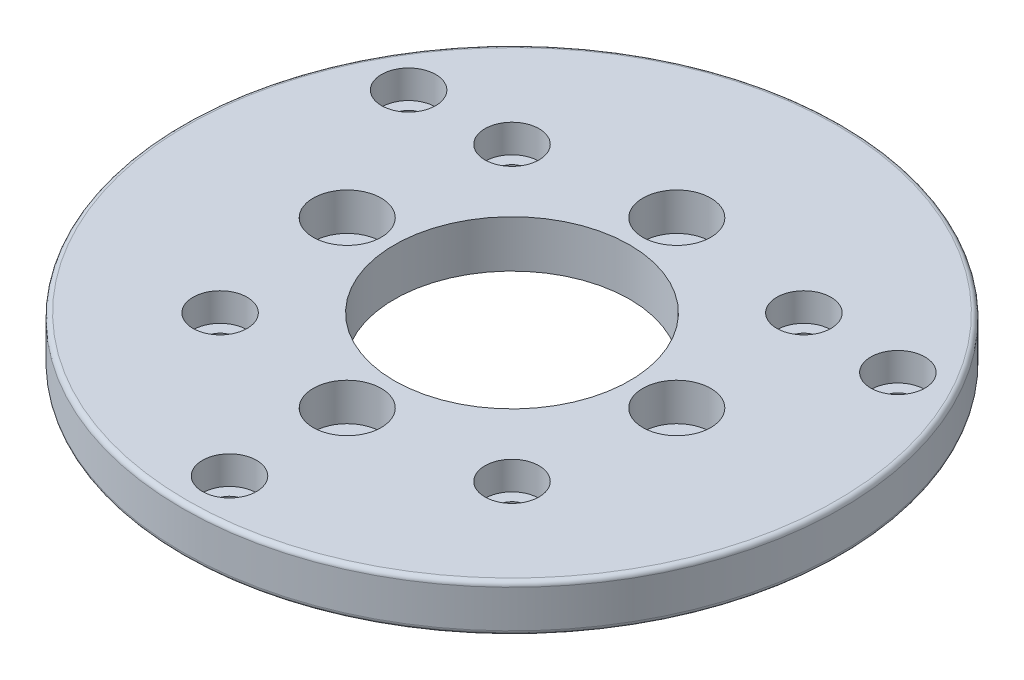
ISO-10303-21;
HEADER;
FILE_DESCRIPTION(('STEP AP214'),'2;1');
FILE_NAME('part.step','',(''),(''),'','','');
FILE_SCHEMA(('AUTOMOTIVE_DESIGN { 1 0 10303 214 1 1 1 1 }'));
ENDSEC;
DATA;
#1=APPLICATION_CONTEXT('core data for automotive mechanical design processes');
#2=APPLICATION_PROTOCOL_DEFINITION('international standard','automotive_design',2000,#1);
#3=PRODUCT_CONTEXT('',#1,'mechanical');
#4=PRODUCT('Part','Part','',(#3));
#5=PRODUCT_RELATED_PRODUCT_CATEGORY('part','',(#4));
#6=PRODUCT_DEFINITION_FORMATION('','',#4);
#7=PRODUCT_DEFINITION_CONTEXT('part definition',#1,'design');
#8=PRODUCT_DEFINITION('design','',#6,#7);
#9=PRODUCT_DEFINITION_SHAPE('','',#8);
#10=(LENGTH_UNIT() NAMED_UNIT(*) SI_UNIT(.MILLI.,.METRE.));
#11=(NAMED_UNIT(*) PLANE_ANGLE_UNIT() SI_UNIT($,.RADIAN.));
#12=(NAMED_UNIT(*) SI_UNIT($,.STERADIAN.) SOLID_ANGLE_UNIT());
#13=UNCERTAINTY_MEASURE_WITH_UNIT(LENGTH_MEASURE(1.E-05),#10,'distance_accuracy_value','');
#14=(GEOMETRIC_REPRESENTATION_CONTEXT(3) GLOBAL_UNCERTAINTY_ASSIGNED_CONTEXT((#13)) GLOBAL_UNIT_ASSIGNED_CONTEXT((#10,
#11,#12)) REPRESENTATION_CONTEXT('',''));
#15=CARTESIAN_POINT('',(0.,0.,0.));
#16=DIRECTION('',(0.,0.,1.));
#17=DIRECTION('',(1.,0.,0.));
#18=AXIS2_PLACEMENT_3D('',#15,#16,#17);
#19=CARTESIAN_POINT('',(17.5,5.,0.));
#20=DIRECTION('',(0.,-1.,0.));
#21=DIRECTION('',(0.,0.,-1.));
#22=AXIS2_PLACEMENT_3D('',#19,#20,#21);
#23=CYLINDRICAL_SURFACE('',#22,2.05);
#24=CARTESIAN_POINT('',(17.5,0.,0.));
#25=DIRECTION('',(0.,1.,0.));
#26=DIRECTION('',(0.,0.,1.));
#27=AXIS2_PLACEMENT_3D('',#24,#25,#26);
#28=CIRCLE('',#27,2.05);
#29=CARTESIAN_POINT('',(17.5,0.,2.05));
#30=VERTEX_POINT('',#29);
#31=EDGE_CURVE('E181',#30,#30,#28,.T.);
#32=ORIENTED_EDGE('',*,*,#31,.F.);
#33=EDGE_LOOP('',(#32));
#34=FACE_BOUND('',#33,.T.);
#35=CARTESIAN_POINT('',(17.5,1.,0.));
#36=DIRECTION('',(0.,1.,0.));
#37=DIRECTION('',(0.,0.,1.));
#38=AXIS2_PLACEMENT_3D('',#35,#36,#37);
#39=CIRCLE('',#38,2.05);
#40=CARTESIAN_POINT('',(17.5,1.,2.05));
#41=VERTEX_POINT('',#40);
#42=EDGE_CURVE('E40',#41,#41,#39,.T.);
#43=ORIENTED_EDGE('',*,*,#42,.T.);
#44=EDGE_LOOP('',(#43));
#45=FACE_BOUND('',#44,.T.);
#46=ADVANCED_FACE('F36',(#34,#45),#23,.F.);
#47=CARTESIAN_POINT('',(0.,5.,-17.5));
#48=DIRECTION('',(0.,-1.,0.));
#49=DIRECTION('',(0.,0.,-1.));
#50=AXIS2_PLACEMENT_3D('',#47,#48,#49);
#51=CYLINDRICAL_SURFACE('',#50,2.05);
#52=CARTESIAN_POINT('',(0.,0.,-17.5));
#53=DIRECTION('',(0.,1.,0.));
#54=DIRECTION('',(0.,0.,1.));
#55=AXIS2_PLACEMENT_3D('',#52,#53,#54);
#56=CIRCLE('',#55,2.05);
#57=CARTESIAN_POINT('',(0.,0.,-15.45));
#58=VERTEX_POINT('',#57);
#59=EDGE_CURVE('E177',#58,#58,#56,.T.);
#60=ORIENTED_EDGE('',*,*,#59,.F.);
#61=EDGE_LOOP('',(#60));
#62=FACE_BOUND('',#61,.T.);
#63=CARTESIAN_POINT('',(0.,1.,-17.5));
#64=DIRECTION('',(0.,1.,0.));
#65=DIRECTION('',(0.,0.,1.));
#66=AXIS2_PLACEMENT_3D('',#63,#64,#65);
#67=CIRCLE('',#66,2.05);
#68=CARTESIAN_POINT('',(0.,1.,-15.45));
#69=VERTEX_POINT('',#68);
#70=EDGE_CURVE('E94',#69,#69,#67,.T.);
#71=ORIENTED_EDGE('',*,*,#70,.T.);
#72=EDGE_LOOP('',(#71));
#73=FACE_BOUND('',#72,.T.);
#74=ADVANCED_FACE('F230',(#62,#73),#51,.F.);
#75=CARTESIAN_POINT('',(-17.5,5.,0.));
#76=DIRECTION('',(0.,-1.,0.));
#77=DIRECTION('',(0.,0.,-1.));
#78=AXIS2_PLACEMENT_3D('',#75,#76,#77);
#79=CYLINDRICAL_SURFACE('',#78,2.05);
#80=CARTESIAN_POINT('',(-17.5,0.,0.));
#81=DIRECTION('',(0.,1.,0.));
#82=DIRECTION('',(0.,0.,1.));
#83=AXIS2_PLACEMENT_3D('',#80,#81,#82);
#84=CIRCLE('',#83,2.05);
#85=CARTESIAN_POINT('',(-17.5,0.,2.05));
#86=VERTEX_POINT('',#85);
#87=EDGE_CURVE('E173',#86,#86,#84,.T.);
#88=ORIENTED_EDGE('',*,*,#87,.F.);
#89=EDGE_LOOP('',(#88));
#90=FACE_BOUND('',#89,.T.);
#91=CARTESIAN_POINT('',(-17.5,1.,0.));
#92=DIRECTION('',(0.,1.,0.));
#93=DIRECTION('',(0.,0.,1.));
#94=AXIS2_PLACEMENT_3D('',#91,#92,#93);
#95=CIRCLE('',#94,2.05);
#96=CARTESIAN_POINT('',(-17.5,1.,2.05));
#97=VERTEX_POINT('',#96);
#98=EDGE_CURVE('E90',#97,#97,#95,.T.);
#99=ORIENTED_EDGE('',*,*,#98,.T.);
#100=EDGE_LOOP('',(#99));
#101=FACE_BOUND('',#100,.T.);
#102=ADVANCED_FACE('F236',(#90,#101),#79,.F.);
#103=CARTESIAN_POINT('',(0.,5.,17.5));
#104=DIRECTION('',(0.,-1.,0.));
#105=DIRECTION('',(0.,0.,-1.));
#106=AXIS2_PLACEMENT_3D('',#103,#104,#105);
#107=CYLINDRICAL_SURFACE('',#106,2.05);
#108=CARTESIAN_POINT('',(0.,0.,17.5));
#109=DIRECTION('',(0.,1.,0.));
#110=DIRECTION('',(0.,0.,1.));
#111=AXIS2_PLACEMENT_3D('',#108,#109,#110);
#112=CIRCLE('',#111,2.05);
#113=CARTESIAN_POINT('',(0.,0.,19.55));
#114=VERTEX_POINT('',#113);
#115=EDGE_CURVE('E170',#114,#114,#112,.T.);
#116=ORIENTED_EDGE('',*,*,#115,.F.);
#117=EDGE_LOOP('',(#116));
#118=FACE_BOUND('',#117,.T.);
#119=CARTESIAN_POINT('',(0.,1.,17.5));
#120=DIRECTION('',(0.,1.,0.));
#121=DIRECTION('',(0.,0.,1.));
#122=AXIS2_PLACEMENT_3D('',#119,#120,#121);
#123=CIRCLE('',#122,2.05);
#124=CARTESIAN_POINT('',(0.,1.,19.55));
#125=VERTEX_POINT('',#124);
#126=EDGE_CURVE('E86',#125,#125,#123,.T.);
#127=ORIENTED_EDGE('',*,*,#126,.T.);
#128=EDGE_LOOP('',(#127));
#129=FACE_BOUND('',#128,.T.);
#130=ADVANCED_FACE('F254',(#118,#129),#107,.F.);
#131=CARTESIAN_POINT('',(-25.9807621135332,5.,-15.));
#132=DIRECTION('',(0.,-1.,0.));
#133=DIRECTION('',(0.,0.,-1.));
#134=AXIS2_PLACEMENT_3D('',#131,#132,#133);
#135=CYLINDRICAL_SURFACE('',#134,1.6);
#136=CARTESIAN_POINT('',(-25.9807621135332,0.,-15.));
#137=DIRECTION('',(0.,1.,0.));
#138=DIRECTION('',(0.,0.,1.));
#139=AXIS2_PLACEMENT_3D('',#136,#137,#138);
#140=CIRCLE('',#139,1.6);
#141=CARTESIAN_POINT('',(-25.9807621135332,0.,-13.4));
#142=VERTEX_POINT('',#141);
#143=EDGE_CURVE('E200',#142,#142,#140,.T.);
#144=ORIENTED_EDGE('',*,*,#143,.F.);
#145=EDGE_LOOP('',(#144));
#146=FACE_BOUND('',#145,.T.);
#147=CARTESIAN_POINT('',(-25.9807621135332,2.,-15.));
#148=DIRECTION('',(0.,1.,0.));
#149=DIRECTION('',(0.,0.,1.));
#150=AXIS2_PLACEMENT_3D('',#147,#148,#149);
#151=CIRCLE('',#150,1.6);
#152=CARTESIAN_POINT('',(-25.9807621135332,2.,-13.4));
#153=VERTEX_POINT('',#152);
#154=EDGE_CURVE('E81',#153,#153,#151,.T.);
#155=ORIENTED_EDGE('',*,*,#154,.T.);
#156=EDGE_LOOP('',(#155));
#157=FACE_BOUND('',#156,.T.);
#158=ADVANCED_FACE('F250',(#146,#157),#135,.F.);
#159=CARTESIAN_POINT('',(25.9807621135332,5.,-15.));
#160=DIRECTION('',(0.,-1.,0.));
#161=DIRECTION('',(0.,0.,-1.));
#162=AXIS2_PLACEMENT_3D('',#159,#160,#161);
#163=CYLINDRICAL_SURFACE('',#162,1.6);
#164=CARTESIAN_POINT('',(25.9807621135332,0.,-15.));
#165=DIRECTION('',(0.,1.,0.));
#166=DIRECTION('',(0.,0.,1.));
#167=AXIS2_PLACEMENT_3D('',#164,#165,#166);
#168=CIRCLE('',#167,1.6);
#169=CARTESIAN_POINT('',(25.9807621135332,0.,-13.4));
#170=VERTEX_POINT('',#169);
#171=EDGE_CURVE('E196',#170,#170,#168,.T.);
#172=ORIENTED_EDGE('',*,*,#171,.F.);
#173=EDGE_LOOP('',(#172));
#174=FACE_BOUND('',#173,.T.);
#175=CARTESIAN_POINT('',(25.9807621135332,2.,-15.));
#176=DIRECTION('',(0.,1.,0.));
#177=DIRECTION('',(0.,0.,1.));
#178=AXIS2_PLACEMENT_3D('',#175,#176,#177);
#179=CIRCLE('',#178,1.6);
#180=CARTESIAN_POINT('',(25.9807621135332,2.,-13.4));
#181=VERTEX_POINT('',#180);
#182=EDGE_CURVE('E77',#181,#181,#179,.T.);
#183=ORIENTED_EDGE('',*,*,#182,.T.);
#184=EDGE_LOOP('',(#183));
#185=FACE_BOUND('',#184,.T.);
#186=ADVANCED_FACE('F246',(#174,#185),#163,.F.);
#187=CARTESIAN_POINT('',(0.,5.,30.));
#188=DIRECTION('',(0.,-1.,0.));
#189=DIRECTION('',(0.,0.,-1.));
#190=AXIS2_PLACEMENT_3D('',#187,#188,#189);
#191=CYLINDRICAL_SURFACE('',#190,1.6);
#192=CARTESIAN_POINT('',(0.,0.,30.));
#193=DIRECTION('',(0.,1.,0.));
#194=DIRECTION('',(0.,0.,1.));
#195=AXIS2_PLACEMENT_3D('',#192,#193,#194);
#196=CIRCLE('',#195,1.6);
#197=CARTESIAN_POINT('',(0.,0.,31.6));
#198=VERTEX_POINT('',#197);
#199=EDGE_CURVE('E189',#198,#198,#196,.T.);
#200=ORIENTED_EDGE('',*,*,#199,.F.);
#201=EDGE_LOOP('',(#200));
#202=FACE_BOUND('',#201,.T.);
#203=CARTESIAN_POINT('',(0.,2.,30.));
#204=DIRECTION('',(0.,1.,0.));
#205=DIRECTION('',(0.,0.,1.));
#206=AXIS2_PLACEMENT_3D('',#203,#204,#205);
#207=CIRCLE('',#206,1.6);
#208=CARTESIAN_POINT('',(0.,2.,31.6));
#209=VERTEX_POINT('',#208);
#210=EDGE_CURVE('E73',#209,#209,#207,.T.);
#211=ORIENTED_EDGE('',*,*,#210,.T.);
#212=EDGE_LOOP('',(#211));
#213=FACE_BOUND('',#212,.T.);
#214=ADVANCED_FACE('F242',(#202,#213),#191,.F.);
#215=CARTESIAN_POINT('',(-15.5,5.,-15.5));
#216=DIRECTION('',(0.,-1.,0.));
#217=DIRECTION('',(0.,0.,-1.));
#218=AXIS2_PLACEMENT_3D('',#215,#216,#217);
#219=CYLINDRICAL_SURFACE('',#218,1.6);
#220=CARTESIAN_POINT('',(-15.5,0.,-15.5));
#221=DIRECTION('',(0.,1.,0.));
#222=DIRECTION('',(0.,0.,1.));
#223=AXIS2_PLACEMENT_3D('',#220,#221,#222);
#224=CIRCLE('',#223,1.6);
#225=CARTESIAN_POINT('',(-15.5,0.,-13.9));
#226=VERTEX_POINT('',#225);
#227=EDGE_CURVE('E166',#226,#226,#224,.T.);
#228=ORIENTED_EDGE('',*,*,#227,.F.);
#229=EDGE_LOOP('',(#228));
#230=FACE_BOUND('',#229,.T.);
#231=CARTESIAN_POINT('',(-15.5,2.,-15.5));
#232=DIRECTION('',(0.,1.,0.));
#233=DIRECTION('',(0.,0.,1.));
#234=AXIS2_PLACEMENT_3D('',#231,#232,#233);
#235=CIRCLE('',#234,1.6);
#236=CARTESIAN_POINT('',(-15.5,2.,-13.9));
#237=VERTEX_POINT('',#236);
#238=EDGE_CURVE('E69',#237,#237,#235,.T.);
#239=ORIENTED_EDGE('',*,*,#238,.T.);
#240=EDGE_LOOP('',(#239));
#241=FACE_BOUND('',#240,.T.);
#242=ADVANCED_FACE('F245',(#230,#241),#219,.F.);
#243=CARTESIAN_POINT('',(15.5,5.,-15.5));
#244=DIRECTION('',(0.,-1.,0.));
#245=DIRECTION('',(0.,0.,-1.));
#246=AXIS2_PLACEMENT_3D('',#243,#244,#245);
#247=CYLINDRICAL_SURFACE('',#246,1.6);
#248=CARTESIAN_POINT('',(15.5,0.,-15.5));
#249=DIRECTION('',(0.,1.,0.));
#250=DIRECTION('',(0.,0.,1.));
#251=AXIS2_PLACEMENT_3D('',#248,#249,#250);
#252=CIRCLE('',#251,1.6);
#253=CARTESIAN_POINT('',(15.5,0.,-13.9));
#254=VERTEX_POINT('',#253);
#255=EDGE_CURVE('E162',#254,#254,#252,.T.);
#256=ORIENTED_EDGE('',*,*,#255,.F.);
#257=EDGE_LOOP('',(#256));
#258=FACE_BOUND('',#257,.T.);
#259=CARTESIAN_POINT('',(15.5,2.,-15.5));
#260=DIRECTION('',(0.,1.,0.));
#261=DIRECTION('',(0.,0.,1.));
#262=AXIS2_PLACEMENT_3D('',#259,#260,#261);
#263=CIRCLE('',#262,1.6);
#264=CARTESIAN_POINT('',(15.5,2.,-13.9));
#265=VERTEX_POINT('',#264);
#266=EDGE_CURVE('E65',#265,#265,#263,.T.);
#267=ORIENTED_EDGE('',*,*,#266,.T.);
#268=EDGE_LOOP('',(#267));
#269=FACE_BOUND('',#268,.T.);
#270=ADVANCED_FACE('F323',(#258,#269),#247,.F.);
#271=CARTESIAN_POINT('',(15.5,5.,15.5));
#272=DIRECTION('',(0.,-1.,0.));
#273=DIRECTION('',(0.,0.,-1.));
#274=AXIS2_PLACEMENT_3D('',#271,#272,#273);
#275=CYLINDRICAL_SURFACE('',#274,1.6);
#276=CARTESIAN_POINT('',(15.5,0.,15.5));
#277=DIRECTION('',(0.,1.,0.));
#278=DIRECTION('',(0.,0.,1.));
#279=AXIS2_PLACEMENT_3D('',#276,#277,#278);
#280=CIRCLE('',#279,1.6);
#281=CARTESIAN_POINT('',(15.5,0.,17.1));
#282=VERTEX_POINT('',#281);
#283=EDGE_CURVE('E158',#282,#282,#280,.T.);
#284=ORIENTED_EDGE('',*,*,#283,.F.);
#285=EDGE_LOOP('',(#284));
#286=FACE_BOUND('',#285,.T.);
#287=CARTESIAN_POINT('',(15.5,2.,15.5));
#288=DIRECTION('',(0.,1.,0.));
#289=DIRECTION('',(0.,0.,1.));
#290=AXIS2_PLACEMENT_3D('',#287,#288,#289);
#291=CIRCLE('',#290,1.6);
#292=CARTESIAN_POINT('',(15.5,2.,17.1));
#293=VERTEX_POINT('',#292);
#294=EDGE_CURVE('E60',#293,#293,#291,.T.);
#295=ORIENTED_EDGE('',*,*,#294,.T.);
#296=EDGE_LOOP('',(#295));
#297=FACE_BOUND('',#296,.T.);
#298=ADVANCED_FACE('F311',(#286,#297),#275,.F.);
#299=CARTESIAN_POINT('',(-15.5,5.,15.5));
#300=DIRECTION('',(0.,-1.,0.));
#301=DIRECTION('',(0.,0.,-1.));
#302=AXIS2_PLACEMENT_3D('',#299,#300,#301);
#303=CYLINDRICAL_SURFACE('',#302,1.6);
#304=CARTESIAN_POINT('',(-15.5,0.,15.5));
#305=DIRECTION('',(0.,1.,0.));
#306=DIRECTION('',(0.,0.,1.));
#307=AXIS2_PLACEMENT_3D('',#304,#305,#306);
#308=CIRCLE('',#307,1.6);
#309=CARTESIAN_POINT('',(-15.5,0.,17.1));
#310=VERTEX_POINT('',#309);
#311=EDGE_CURVE('E85',#310,#310,#308,.T.);
#312=ORIENTED_EDGE('',*,*,#311,.F.);
#313=EDGE_LOOP('',(#312));
#314=FACE_BOUND('',#313,.T.);
#315=CARTESIAN_POINT('',(-15.5,2.,15.5));
#316=DIRECTION('',(0.,1.,0.));
#317=DIRECTION('',(0.,0.,1.));
#318=AXIS2_PLACEMENT_3D('',#315,#316,#317);
#319=CIRCLE('',#318,1.6);
#320=CARTESIAN_POINT('',(-15.5,2.,17.1));
#321=VERTEX_POINT('',#320);
#322=EDGE_CURVE('E56',#321,#321,#319,.T.);
#323=ORIENTED_EDGE('',*,*,#322,.T.);
#324=EDGE_LOOP('',(#323));
#325=FACE_BOUND('',#324,.T.);
#326=ADVANCED_FACE('F260',(#314,#325),#303,.F.);
#327=CARTESIAN_POINT('',(0.,5.,0.));
#328=DIRECTION('',(0.,1.,0.));
#329=DIRECTION('',(0.,0.,1.));
#330=AXIS2_PLACEMENT_3D('',#327,#328,#329);
#331=PLANE('',#330);
#332=CARTESIAN_POINT('',(0.,5.,-17.5));
#333=DIRECTION('',(0.,1.,0.));
#334=DIRECTION('',(0.,0.,1.));
#335=AXIS2_PLACEMENT_3D('',#332,#333,#334);
#336=CIRCLE('',#335,3.61);
#337=CARTESIAN_POINT('',(0.,5.,-13.89));
#338=VERTEX_POINT('',#337);
#339=EDGE_CURVE('E690',#338,#338,#336,.T.);
#340=ORIENTED_EDGE('',*,*,#339,.F.);
#341=EDGE_LOOP('',(#340));
#342=FACE_BOUND('',#341,.T.);
#343=CARTESIAN_POINT('',(17.5,5.,0.));
#344=DIRECTION('',(0.,1.,0.));
#345=DIRECTION('',(0.,0.,1.));
#346=AXIS2_PLACEMENT_3D('',#343,#344,#345);
#347=CIRCLE('',#346,3.61);
#348=CARTESIAN_POINT('',(17.5,5.,3.61));
#349=VERTEX_POINT('',#348);
#350=EDGE_CURVE('E683',#349,#349,#347,.T.);
#351=ORIENTED_EDGE('',*,*,#350,.F.);
#352=EDGE_LOOP('',(#351));
#353=FACE_BOUND('',#352,.T.);
#354=CARTESIAN_POINT('',(0.,5.,17.5));
#355=DIRECTION('',(0.,1.,0.));
#356=DIRECTION('',(0.,0.,1.));
#357=AXIS2_PLACEMENT_3D('',#354,#355,#356);
#358=CIRCLE('',#357,3.61);
#359=CARTESIAN_POINT('',(0.,5.,21.11));
#360=VERTEX_POINT('',#359);
#361=EDGE_CURVE('E684',#360,#360,#358,.T.);
#362=ORIENTED_EDGE('',*,*,#361,.F.);
#363=EDGE_LOOP('',(#362));
#364=FACE_BOUND('',#363,.T.);
#365=CARTESIAN_POINT('',(-17.5,5.,0.));
#366=DIRECTION('',(0.,1.,0.));
#367=DIRECTION('',(0.,0.,1.));
#368=AXIS2_PLACEMENT_3D('',#365,#366,#367);
#369=CIRCLE('',#368,3.61);
#370=CARTESIAN_POINT('',(-17.5,5.,3.61));
#371=VERTEX_POINT('',#370);
#372=EDGE_CURVE('E700',#371,#371,#369,.T.);
#373=ORIENTED_EDGE('',*,*,#372,.F.);
#374=EDGE_LOOP('',(#373));
#375=FACE_BOUND('',#374,.T.);
#376=CARTESIAN_POINT('',(-25.9807621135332,5.,-15.));
#377=DIRECTION('',(0.,1.,0.));
#378=DIRECTION('',(0.,0.,1.));
#379=AXIS2_PLACEMENT_3D('',#376,#377,#378);
#380=CIRCLE('',#379,2.875);
#381=CARTESIAN_POINT('',(-25.9807621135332,5.,-12.125));
#382=VERTEX_POINT('',#381);
#383=EDGE_CURVE('E143',#382,#382,#380,.T.);
#384=ORIENTED_EDGE('',*,*,#383,.F.);
#385=EDGE_LOOP('',(#384));
#386=FACE_BOUND('',#385,.T.);
#387=CARTESIAN_POINT('',(-15.5,5.,15.5));
#388=DIRECTION('',(0.,1.,0.));
#389=DIRECTION('',(0.,0.,1.));
#390=AXIS2_PLACEMENT_3D('',#387,#388,#389);
#391=CIRCLE('',#390,2.875);
#392=CARTESIAN_POINT('',(-15.5,5.,18.375));
#393=VERTEX_POINT('',#392);
#394=EDGE_CURVE('E109',#393,#393,#391,.T.);
#395=ORIENTED_EDGE('',*,*,#394,.F.);
#396=EDGE_LOOP('',(#395));
#397=FACE_BOUND('',#396,.T.);
#398=CARTESIAN_POINT('',(15.5,5.,15.5));
#399=DIRECTION('',(0.,1.,0.));
#400=DIRECTION('',(0.,0.,1.));
#401=AXIS2_PLACEMENT_3D('',#398,#399,#400);
#402=CIRCLE('',#401,2.875);
#403=CARTESIAN_POINT('',(15.5,5.,18.375));
#404=VERTEX_POINT('',#403);
#405=EDGE_CURVE('E138',#404,#404,#402,.T.);
#406=ORIENTED_EDGE('',*,*,#405,.F.);
#407=EDGE_LOOP('',(#406));
#408=FACE_BOUND('',#407,.T.);
#409=CARTESIAN_POINT('',(25.9807621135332,5.,-15.));
#410=DIRECTION('',(0.,1.,0.));
#411=DIRECTION('',(0.,0.,1.));
#412=AXIS2_PLACEMENT_3D('',#409,#410,#411);
#413=CIRCLE('',#412,2.875);
#414=CARTESIAN_POINT('',(25.9807621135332,5.,-12.125));
#415=VERTEX_POINT('',#414);
#416=EDGE_CURVE('E139',#415,#415,#413,.T.);
#417=ORIENTED_EDGE('',*,*,#416,.F.);
#418=EDGE_LOOP('',(#417));
#419=FACE_BOUND('',#418,.T.);
#420=CARTESIAN_POINT('',(0.,5.,30.));
#421=DIRECTION('',(0.,1.,0.));
#422=DIRECTION('',(0.,0.,1.));
#423=AXIS2_PLACEMENT_3D('',#420,#421,#422);
#424=CIRCLE('',#423,2.875);
#425=CARTESIAN_POINT('',(0.,5.,32.875));
#426=VERTEX_POINT('',#425);
#427=EDGE_CURVE('E148',#426,#426,#424,.T.);
#428=ORIENTED_EDGE('',*,*,#427,.F.);
#429=EDGE_LOOP('',(#428));
#430=FACE_BOUND('',#429,.T.);
#431=CARTESIAN_POINT('',(-15.5,5.,-15.5));
#432=DIRECTION('',(0.,1.,0.));
#433=DIRECTION('',(0.,0.,1.));
#434=AXIS2_PLACEMENT_3D('',#431,#432,#433);
#435=CIRCLE('',#434,2.875);
#436=CARTESIAN_POINT('',(-15.5,5.,-12.625));
#437=VERTEX_POINT('',#436);
#438=EDGE_CURVE('E121',#437,#437,#435,.T.);
#439=ORIENTED_EDGE('',*,*,#438,.F.);
#440=EDGE_LOOP('',(#439));
#441=FACE_BOUND('',#440,.T.);
#442=CARTESIAN_POINT('',(15.5,5.,-15.5));
#443=DIRECTION('',(0.,1.,0.));
#444=DIRECTION('',(0.,0.,1.));
#445=AXIS2_PLACEMENT_3D('',#442,#443,#444);
#446=CIRCLE('',#445,2.875);
#447=CARTESIAN_POINT('',(15.5,5.,-12.625));
#448=VERTEX_POINT('',#447);
#449=EDGE_CURVE('E130',#448,#448,#446,.T.);
#450=ORIENTED_EDGE('',*,*,#449,.F.);
#451=EDGE_LOOP('',(#450));
#452=FACE_BOUND('',#451,.T.);
#453=CARTESIAN_POINT('',(0.,5.,0.));
#454=DIRECTION('',(0.,1.,0.));
#455=DIRECTION('',(0.,0.,1.));
#456=AXIS2_PLACEMENT_3D('',#453,#454,#455);
#457=CIRCLE('',#456,34.5);
#458=CARTESIAN_POINT('',(0.,5.,34.5));
#459=VERTEX_POINT('',#458);
#460=EDGE_CURVE('E10',#459,#459,#457,.T.);
#461=ORIENTED_EDGE('',*,*,#460,.T.);
#462=EDGE_LOOP('',(#461));
#463=FACE_BOUND('',#462,.T.);
#464=CARTESIAN_POINT('',(0.,5.,0.));
#465=DIRECTION('',(0.,1.,0.));
#466=DIRECTION('',(0.,0.,1.));
#467=AXIS2_PLACEMENT_3D('',#464,#465,#466);
#468=CIRCLE('',#467,12.5);
#469=CARTESIAN_POINT('',(0.,5.,12.5));
#470=VERTEX_POINT('',#469);
#471=EDGE_CURVE('E185',#470,#470,#468,.T.);
#472=ORIENTED_EDGE('',*,*,#471,.F.);
#473=EDGE_LOOP('',(#472));
#474=FACE_BOUND('',#473,.T.);
#475=ADVANCED_FACE('F256',(#342,#353,#364,#375,#386,#397,#408,#419,#430,#441,#452,#463,#474),
#331,.T.);
#476=CARTESIAN_POINT('',(0.,0.,0.));
#477=DIRECTION('',(0.,1.,0.));
#478=DIRECTION('',(0.,0.,1.));
#479=AXIS2_PLACEMENT_3D('',#476,#477,#478);
#480=PLANE('',#479);
#481=CARTESIAN_POINT('',(0.,0.,0.));
#482=DIRECTION('',(0.,1.,0.));
#483=DIRECTION('',(0.,0.,1.));
#484=AXIS2_PLACEMENT_3D('',#481,#482,#483);
#485=CIRCLE('',#484,34.5);
#486=CARTESIAN_POINT('',(0.,0.,34.5));
#487=VERTEX_POINT('',#486);
#488=EDGE_CURVE('E45',#487,#487,#485,.F.);
#489=ORIENTED_EDGE('',*,*,#488,.T.);
#490=EDGE_LOOP('',(#489));
#491=FACE_BOUND('',#490,.T.);
#492=ORIENTED_EDGE('',*,*,#143,.T.);
#493=EDGE_LOOP('',(#492));
#494=FACE_BOUND('',#493,.T.);
#495=ORIENTED_EDGE('',*,*,#171,.T.);
#496=EDGE_LOOP('',(#495));
#497=FACE_BOUND('',#496,.T.);
#498=ORIENTED_EDGE('',*,*,#199,.T.);
#499=EDGE_LOOP('',(#498));
#500=FACE_BOUND('',#499,.T.);
#501=CARTESIAN_POINT('',(0.,0.,0.));
#502=DIRECTION('',(0.,1.,0.));
#503=DIRECTION('',(0.,0.,1.));
#504=AXIS2_PLACEMENT_3D('',#501,#502,#503);
#505=CIRCLE('',#504,12.5);
#506=CARTESIAN_POINT('',(0.,0.,12.5));
#507=VERTEX_POINT('',#506);
#508=EDGE_CURVE('E184',#507,#507,#505,.T.);
#509=ORIENTED_EDGE('',*,*,#508,.T.);
#510=EDGE_LOOP('',(#509));
#511=FACE_BOUND('',#510,.T.);
#512=ORIENTED_EDGE('',*,*,#31,.T.);
#513=EDGE_LOOP('',(#512));
#514=FACE_BOUND('',#513,.T.);
#515=ORIENTED_EDGE('',*,*,#59,.T.);
#516=EDGE_LOOP('',(#515));
#517=FACE_BOUND('',#516,.T.);
#518=ORIENTED_EDGE('',*,*,#87,.T.);
#519=EDGE_LOOP('',(#518));
#520=FACE_BOUND('',#519,.T.);
#521=ORIENTED_EDGE('',*,*,#115,.T.);
#522=EDGE_LOOP('',(#521));
#523=FACE_BOUND('',#522,.T.);
#524=ORIENTED_EDGE('',*,*,#227,.T.);
#525=EDGE_LOOP('',(#524));
#526=FACE_BOUND('',#525,.T.);
#527=ORIENTED_EDGE('',*,*,#255,.T.);
#528=EDGE_LOOP('',(#527));
#529=FACE_BOUND('',#528,.T.);
#530=ORIENTED_EDGE('',*,*,#283,.T.);
#531=EDGE_LOOP('',(#530));
#532=FACE_BOUND('',#531,.T.);
#533=ORIENTED_EDGE('',*,*,#311,.T.);
#534=EDGE_LOOP('',(#533));
#535=FACE_BOUND('',#534,.T.);
#536=ADVANCED_FACE('F259',(#491,#494,#497,#500,#511,#514,#517,#520,#523,#526,#529,#532,#535),
#480,.F.);
#537=CARTESIAN_POINT('',(0.,5.,0.));
#538=DIRECTION('',(0.,-1.,0.));
#539=DIRECTION('',(0.,0.,-1.));
#540=AXIS2_PLACEMENT_3D('',#537,#538,#539);
#541=CYLINDRICAL_SURFACE('',#540,35.);
#542=CARTESIAN_POINT('',(0.,0.5,0.));
#543=DIRECTION('',(0.,1.,0.));
#544=DIRECTION('',(0.,0.,1.));
#545=AXIS2_PLACEMENT_3D('',#542,#543,#544);
#546=CIRCLE('',#545,35.);
#547=CARTESIAN_POINT('',(0.,0.5,35.));
#548=VERTEX_POINT('',#547);
#549=EDGE_CURVE('E52',#548,#548,#546,.T.);
#550=ORIENTED_EDGE('',*,*,#549,.T.);
#551=EDGE_LOOP('',(#550));
#552=FACE_BOUND('',#551,.T.);
#553=CARTESIAN_POINT('',(0.,4.5,0.));
#554=DIRECTION('',(0.,1.,0.));
#555=DIRECTION('',(0.,0.,1.));
#556=AXIS2_PLACEMENT_3D('',#553,#554,#555);
#557=CIRCLE('',#556,35.);
#558=CARTESIAN_POINT('',(0.,4.5,35.));
#559=VERTEX_POINT('',#558);
#560=EDGE_CURVE('E204',#559,#559,#557,.F.);
#561=ORIENTED_EDGE('',*,*,#560,.T.);
#562=EDGE_LOOP('',(#561));
#563=FACE_BOUND('',#562,.T.);
#564=ADVANCED_FACE('F212',(#552,#563),#541,.T.);
#565=CARTESIAN_POINT('',(0.,5.,0.));
#566=DIRECTION('',(0.,-1.,0.));
#567=DIRECTION('',(0.,0.,-1.));
#568=AXIS2_PLACEMENT_3D('',#565,#566,#567);
#569=CYLINDRICAL_SURFACE('',#568,12.5);
#570=ORIENTED_EDGE('',*,*,#471,.T.);
#571=EDGE_LOOP('',(#570));
#572=FACE_BOUND('',#571,.T.);
#573=ORIENTED_EDGE('',*,*,#508,.F.);
#574=EDGE_LOOP('',(#573));
#575=FACE_BOUND('',#574,.T.);
#576=ADVANCED_FACE('F217',(#572,#575),#569,.F.);
#577=CARTESIAN_POINT('',(0.,0.5,0.));
#578=DIRECTION('',(0.,1.,0.));
#579=DIRECTION('',(0.,0.,1.));
#580=AXIS2_PLACEMENT_3D('',#577,#578,#579);
#581=TOROIDAL_SURFACE('',#580,34.5,0.5);
#582=ORIENTED_EDGE('',*,*,#488,.F.);
#583=EDGE_LOOP('',(#582));
#584=FACE_BOUND('',#583,.T.);
#585=ORIENTED_EDGE('',*,*,#549,.F.);
#586=EDGE_LOOP('',(#585));
#587=FACE_BOUND('',#586,.T.);
#588=ADVANCED_FACE('F215',(#584,#587),#581,.T.);
#589=CARTESIAN_POINT('',(0.,4.5,0.));
#590=DIRECTION('',(0.,1.,0.));
#591=DIRECTION('',(0.,0.,1.));
#592=AXIS2_PLACEMENT_3D('',#589,#590,#591);
#593=TOROIDAL_SURFACE('',#592,34.5,0.5);
#594=ORIENTED_EDGE('',*,*,#560,.F.);
#595=EDGE_LOOP('',(#594));
#596=FACE_BOUND('',#595,.T.);
#597=ORIENTED_EDGE('',*,*,#460,.F.);
#598=EDGE_LOOP('',(#597));
#599=FACE_BOUND('',#598,.T.);
#600=ADVANCED_FACE('F38',(#596,#599),#593,.T.);
#601=CARTESIAN_POINT('',(-15.5,2.,15.5));
#602=DIRECTION('',(0.,1.,0.));
#603=DIRECTION('',(0.,0.,1.));
#604=AXIS2_PLACEMENT_3D('',#601,#602,#603);
#605=CYLINDRICAL_SURFACE('',#604,2.875);
#606=CARTESIAN_POINT('',(-15.5,2.,15.5));
#607=DIRECTION('',(0.,1.,0.));
#608=DIRECTION('',(0.,0.,1.));
#609=AXIS2_PLACEMENT_3D('',#606,#607,#608);
#610=CIRCLE('',#609,2.875);
#611=CARTESIAN_POINT('',(-15.5,2.,18.375));
#612=VERTEX_POINT('',#611);
#613=EDGE_CURVE('E102',#612,#612,#610,.T.);
#614=ORIENTED_EDGE('',*,*,#613,.F.);
#615=EDGE_LOOP('',(#614));
#616=FACE_BOUND('',#615,.T.);
#617=ORIENTED_EDGE('',*,*,#394,.T.);
#618=EDGE_LOOP('',(#617));
#619=FACE_BOUND('',#618,.T.);
#620=ADVANCED_FACE('F223',(#616,#619),#605,.F.);
#621=CARTESIAN_POINT('',(-15.5,2.,15.5));
#622=DIRECTION('',(0.,1.,0.));
#623=DIRECTION('',(0.,0.,1.));
#624=AXIS2_PLACEMENT_3D('',#621,#622,#623);
#625=PLANE('',#624);
#626=ORIENTED_EDGE('',*,*,#322,.F.);
#627=EDGE_LOOP('',(#626));
#628=FACE_BOUND('',#627,.T.);
#629=ORIENTED_EDGE('',*,*,#613,.T.);
#630=EDGE_LOOP('',(#629));
#631=FACE_BOUND('',#630,.T.);
#632=ADVANCED_FACE('F374',(#628,#631),#625,.T.);
#633=CARTESIAN_POINT('',(15.5,2.,15.5));
#634=DIRECTION('',(0.,1.,0.));
#635=DIRECTION('',(0.,0.,1.));
#636=AXIS2_PLACEMENT_3D('',#633,#634,#635);
#637=CYLINDRICAL_SURFACE('',#636,2.875);
#638=CARTESIAN_POINT('',(15.5,2.,15.5));
#639=DIRECTION('',(0.,1.,0.));
#640=DIRECTION('',(0.,0.,1.));
#641=AXIS2_PLACEMENT_3D('',#638,#639,#640);
#642=CIRCLE('',#641,2.875);
#643=CARTESIAN_POINT('',(15.5,2.,18.375));
#644=VERTEX_POINT('',#643);
#645=EDGE_CURVE('E117',#644,#644,#642,.T.);
#646=ORIENTED_EDGE('',*,*,#645,.F.);
#647=EDGE_LOOP('',(#646));
#648=FACE_BOUND('',#647,.T.);
#649=ORIENTED_EDGE('',*,*,#405,.T.);
#650=EDGE_LOOP('',(#649));
#651=FACE_BOUND('',#650,.T.);
#652=ADVANCED_FACE('F383',(#648,#651),#637,.F.);
#653=CARTESIAN_POINT('',(15.5,2.,15.5));
#654=DIRECTION('',(0.,1.,0.));
#655=DIRECTION('',(0.,0.,1.));
#656=AXIS2_PLACEMENT_3D('',#653,#654,#655);
#657=PLANE('',#656);
#658=ORIENTED_EDGE('',*,*,#294,.F.);
#659=EDGE_LOOP('',(#658));
#660=FACE_BOUND('',#659,.T.);
#661=ORIENTED_EDGE('',*,*,#645,.T.);
#662=EDGE_LOOP('',(#661));
#663=FACE_BOUND('',#662,.T.);
#664=ADVANCED_FACE('F393',(#660,#663),#657,.T.);
#665=CARTESIAN_POINT('',(15.5,2.,-15.5));
#666=DIRECTION('',(0.,1.,0.));
#667=DIRECTION('',(0.,0.,1.));
#668=AXIS2_PLACEMENT_3D('',#665,#666,#667);
#669=CYLINDRICAL_SURFACE('',#668,2.875);
#670=CARTESIAN_POINT('',(15.5,2.,-15.5));
#671=DIRECTION('',(0.,1.,0.));
#672=DIRECTION('',(0.,0.,1.));
#673=AXIS2_PLACEMENT_3D('',#670,#671,#672);
#674=CIRCLE('',#673,2.875);
#675=CARTESIAN_POINT('',(15.5,2.,-12.625));
#676=VERTEX_POINT('',#675);
#677=EDGE_CURVE('E134',#676,#676,#674,.T.);
#678=ORIENTED_EDGE('',*,*,#677,.F.);
#679=EDGE_LOOP('',(#678));
#680=FACE_BOUND('',#679,.T.);
#681=ORIENTED_EDGE('',*,*,#449,.T.);
#682=EDGE_LOOP('',(#681));
#683=FACE_BOUND('',#682,.T.);
#684=ADVANCED_FACE('F403',(#680,#683),#669,.F.);
#685=CARTESIAN_POINT('',(15.5,2.,-15.5));
#686=DIRECTION('',(0.,1.,0.));
#687=DIRECTION('',(0.,0.,1.));
#688=AXIS2_PLACEMENT_3D('',#685,#686,#687);
#689=PLANE('',#688);
#690=ORIENTED_EDGE('',*,*,#266,.F.);
#691=EDGE_LOOP('',(#690));
#692=FACE_BOUND('',#691,.T.);
#693=ORIENTED_EDGE('',*,*,#677,.T.);
#694=EDGE_LOOP('',(#693));
#695=FACE_BOUND('',#694,.T.);
#696=ADVANCED_FACE('F413',(#692,#695),#689,.T.);
#697=CARTESIAN_POINT('',(-15.5,2.,-15.5));
#698=DIRECTION('',(0.,1.,0.));
#699=DIRECTION('',(0.,0.,1.));
#700=AXIS2_PLACEMENT_3D('',#697,#698,#699);
#701=CYLINDRICAL_SURFACE('',#700,2.875);
#702=CARTESIAN_POINT('',(-15.5,2.,-15.5));
#703=DIRECTION('',(0.,1.,0.));
#704=DIRECTION('',(0.,0.,1.));
#705=AXIS2_PLACEMENT_3D('',#702,#703,#704);
#706=CIRCLE('',#705,2.875);
#707=CARTESIAN_POINT('',(-15.5,2.,-12.625));
#708=VERTEX_POINT('',#707);
#709=EDGE_CURVE('E126',#708,#708,#706,.T.);
#710=ORIENTED_EDGE('',*,*,#709,.F.);
#711=EDGE_LOOP('',(#710));
#712=FACE_BOUND('',#711,.T.);
#713=ORIENTED_EDGE('',*,*,#438,.T.);
#714=EDGE_LOOP('',(#713));
#715=FACE_BOUND('',#714,.T.);
#716=ADVANCED_FACE('F423',(#712,#715),#701,.F.);
#717=CARTESIAN_POINT('',(-15.5,2.,-15.5));
#718=DIRECTION('',(0.,1.,0.));
#719=DIRECTION('',(0.,0.,1.));
#720=AXIS2_PLACEMENT_3D('',#717,#718,#719);
#721=PLANE('',#720);
#722=ORIENTED_EDGE('',*,*,#238,.F.);
#723=EDGE_LOOP('',(#722));
#724=FACE_BOUND('',#723,.T.);
#725=ORIENTED_EDGE('',*,*,#709,.T.);
#726=EDGE_LOOP('',(#725));
#727=FACE_BOUND('',#726,.T.);
#728=ADVANCED_FACE('F433',(#724,#727),#721,.T.);
#729=CARTESIAN_POINT('',(0.,2.,30.));
#730=DIRECTION('',(0.,1.,0.));
#731=DIRECTION('',(0.,0.,1.));
#732=AXIS2_PLACEMENT_3D('',#729,#730,#731);
#733=CYLINDRICAL_SURFACE('',#732,2.875);
#734=CARTESIAN_POINT('',(0.,2.,30.));
#735=DIRECTION('',(0.,1.,0.));
#736=DIRECTION('',(0.,0.,1.));
#737=AXIS2_PLACEMENT_3D('',#734,#735,#736);
#738=CIRCLE('',#737,2.875);
#739=CARTESIAN_POINT('',(0.,2.,32.875));
#740=VERTEX_POINT('',#739);
#741=EDGE_CURVE('E125',#740,#740,#738,.T.);
#742=ORIENTED_EDGE('',*,*,#741,.F.);
#743=EDGE_LOOP('',(#742));
#744=FACE_BOUND('',#743,.T.);
#745=ORIENTED_EDGE('',*,*,#427,.T.);
#746=EDGE_LOOP('',(#745));
#747=FACE_BOUND('',#746,.T.);
#748=ADVANCED_FACE('F443',(#744,#747),#733,.F.);
#749=CARTESIAN_POINT('',(0.,2.,30.));
#750=DIRECTION('',(0.,1.,0.));
#751=DIRECTION('',(0.,0.,1.));
#752=AXIS2_PLACEMENT_3D('',#749,#750,#751);
#753=PLANE('',#752);
#754=ORIENTED_EDGE('',*,*,#210,.F.);
#755=EDGE_LOOP('',(#754));
#756=FACE_BOUND('',#755,.T.);
#757=ORIENTED_EDGE('',*,*,#741,.T.);
#758=EDGE_LOOP('',(#757));
#759=FACE_BOUND('',#758,.T.);
#760=ADVANCED_FACE('F453',(#756,#759),#753,.T.);
#761=CARTESIAN_POINT('',(25.9807621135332,2.,-15.));
#762=DIRECTION('',(0.,1.,0.));
#763=DIRECTION('',(0.,0.,1.));
#764=AXIS2_PLACEMENT_3D('',#761,#762,#763);
#765=CYLINDRICAL_SURFACE('',#764,2.875);
#766=CARTESIAN_POINT('',(25.9807621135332,2.,-15.));
#767=DIRECTION('',(0.,1.,0.));
#768=DIRECTION('',(0.,0.,1.));
#769=AXIS2_PLACEMENT_3D('',#766,#767,#768);
#770=CIRCLE('',#769,2.875);
#771=CARTESIAN_POINT('',(25.9807621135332,2.,-12.125));
#772=VERTEX_POINT('',#771);
#773=EDGE_CURVE('E144',#772,#772,#770,.T.);
#774=ORIENTED_EDGE('',*,*,#773,.F.);
#775=EDGE_LOOP('',(#774));
#776=FACE_BOUND('',#775,.T.);
#777=ORIENTED_EDGE('',*,*,#416,.T.);
#778=EDGE_LOOP('',(#777));
#779=FACE_BOUND('',#778,.T.);
#780=ADVANCED_FACE('F463',(#776,#779),#765,.F.);
#781=CARTESIAN_POINT('',(25.9807621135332,2.,-15.));
#782=DIRECTION('',(0.,1.,0.));
#783=DIRECTION('',(0.,0.,1.));
#784=AXIS2_PLACEMENT_3D('',#781,#782,#783);
#785=PLANE('',#784);
#786=ORIENTED_EDGE('',*,*,#182,.F.);
#787=EDGE_LOOP('',(#786));
#788=FACE_BOUND('',#787,.T.);
#789=ORIENTED_EDGE('',*,*,#773,.T.);
#790=EDGE_LOOP('',(#789));
#791=FACE_BOUND('',#790,.T.);
#792=ADVANCED_FACE('F473',(#788,#791),#785,.T.);
#793=CARTESIAN_POINT('',(-25.9807621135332,2.,-15.));
#794=DIRECTION('',(0.,1.,0.));
#795=DIRECTION('',(0.,0.,1.));
#796=AXIS2_PLACEMENT_3D('',#793,#794,#795);
#797=CYLINDRICAL_SURFACE('',#796,2.875);
#798=CARTESIAN_POINT('',(-25.9807621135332,2.,-15.));
#799=DIRECTION('',(0.,1.,0.));
#800=DIRECTION('',(0.,0.,1.));
#801=AXIS2_PLACEMENT_3D('',#798,#799,#800);
#802=CIRCLE('',#801,2.875);
#803=CARTESIAN_POINT('',(-25.9807621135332,2.,-12.125));
#804=VERTEX_POINT('',#803);
#805=EDGE_CURVE('E61',#804,#804,#802,.T.);
#806=ORIENTED_EDGE('',*,*,#805,.F.);
#807=EDGE_LOOP('',(#806));
#808=FACE_BOUND('',#807,.T.);
#809=ORIENTED_EDGE('',*,*,#383,.T.);
#810=EDGE_LOOP('',(#809));
#811=FACE_BOUND('',#810,.T.);
#812=ADVANCED_FACE('F483',(#808,#811),#797,.F.);
#813=CARTESIAN_POINT('',(-25.9807621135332,2.,-15.));
#814=DIRECTION('',(0.,1.,0.));
#815=DIRECTION('',(0.,0.,1.));
#816=AXIS2_PLACEMENT_3D('',#813,#814,#815);
#817=PLANE('',#816);
#818=ORIENTED_EDGE('',*,*,#154,.F.);
#819=EDGE_LOOP('',(#818));
#820=FACE_BOUND('',#819,.T.);
#821=ORIENTED_EDGE('',*,*,#805,.T.);
#822=EDGE_LOOP('',(#821));
#823=FACE_BOUND('',#822,.T.);
#824=ADVANCED_FACE('F493',(#820,#823),#817,.T.);
#825=CARTESIAN_POINT('',(0.,1.,17.5));
#826=DIRECTION('',(0.,1.,0.));
#827=DIRECTION('',(0.,0.,1.));
#828=AXIS2_PLACEMENT_3D('',#825,#826,#827);
#829=CYLINDRICAL_SURFACE('',#828,3.61);
#830=CARTESIAN_POINT('',(0.,1.,17.5));
#831=DIRECTION('',(0.,1.,0.));
#832=DIRECTION('',(0.,0.,1.));
#833=AXIS2_PLACEMENT_3D('',#830,#831,#832);
#834=CIRCLE('',#833,3.61);
#835=CARTESIAN_POINT('',(0.,1.,21.11));
#836=VERTEX_POINT('',#835);
#837=EDGE_CURVE('E693',#836,#836,#834,.T.);
#838=ORIENTED_EDGE('',*,*,#837,.F.);
#839=EDGE_LOOP('',(#838));
#840=FACE_BOUND('',#839,.T.);
#841=ORIENTED_EDGE('',*,*,#361,.T.);
#842=EDGE_LOOP('',(#841));
#843=FACE_BOUND('',#842,.T.);
#844=ADVANCED_FACE('F503',(#840,#843),#829,.F.);
#845=CARTESIAN_POINT('',(0.,1.,17.5));
#846=DIRECTION('',(0.,1.,0.));
#847=DIRECTION('',(0.,0.,1.));
#848=AXIS2_PLACEMENT_3D('',#845,#846,#847);
#849=PLANE('',#848);
#850=ORIENTED_EDGE('',*,*,#126,.F.);
#851=EDGE_LOOP('',(#850));
#852=FACE_BOUND('',#851,.T.);
#853=ORIENTED_EDGE('',*,*,#837,.T.);
#854=EDGE_LOOP('',(#853));
#855=FACE_BOUND('',#854,.T.);
#856=ADVANCED_FACE('F545',(#852,#855),#849,.T.);
#857=CARTESIAN_POINT('',(-17.5,1.,0.));
#858=DIRECTION('',(0.,1.,0.));
#859=DIRECTION('',(0.,0.,1.));
#860=AXIS2_PLACEMENT_3D('',#857,#858,#859);
#861=CYLINDRICAL_SURFACE('',#860,3.61);
#862=CARTESIAN_POINT('',(-17.5,1.,0.));
#863=DIRECTION('',(0.,1.,0.));
#864=DIRECTION('',(0.,0.,1.));
#865=AXIS2_PLACEMENT_3D('',#862,#863,#864);
#866=CIRCLE('',#865,3.61);
#867=CARTESIAN_POINT('',(-17.5,1.,3.61));
#868=VERTEX_POINT('',#867);
#869=EDGE_CURVE('E704',#868,#868,#866,.T.);
#870=ORIENTED_EDGE('',*,*,#869,.F.);
#871=EDGE_LOOP('',(#870));
#872=FACE_BOUND('',#871,.T.);
#873=ORIENTED_EDGE('',*,*,#372,.T.);
#874=EDGE_LOOP('',(#873));
#875=FACE_BOUND('',#874,.T.);
#876=ADVANCED_FACE('F555',(#872,#875),#861,.F.);
#877=CARTESIAN_POINT('',(-17.5,1.,0.));
#878=DIRECTION('',(0.,1.,0.));
#879=DIRECTION('',(0.,0.,1.));
#880=AXIS2_PLACEMENT_3D('',#877,#878,#879);
#881=PLANE('',#880);
#882=ORIENTED_EDGE('',*,*,#98,.F.);
#883=EDGE_LOOP('',(#882));
#884=FACE_BOUND('',#883,.T.);
#885=ORIENTED_EDGE('',*,*,#869,.T.);
#886=EDGE_LOOP('',(#885));
#887=FACE_BOUND('',#886,.T.);
#888=ADVANCED_FACE('F565',(#884,#887),#881,.T.);
#889=CARTESIAN_POINT('',(0.,1.,-17.5));
#890=DIRECTION('',(0.,1.,0.));
#891=DIRECTION('',(0.,0.,1.));
#892=AXIS2_PLACEMENT_3D('',#889,#890,#891);
#893=CYLINDRICAL_SURFACE('',#892,3.61);
#894=CARTESIAN_POINT('',(0.,1.,-17.5));
#895=DIRECTION('',(0.,1.,0.));
#896=DIRECTION('',(0.,0.,1.));
#897=AXIS2_PLACEMENT_3D('',#894,#895,#896);
#898=CIRCLE('',#897,3.61);
#899=CARTESIAN_POINT('',(0.,1.,-13.89));
#900=VERTEX_POINT('',#899);
#901=EDGE_CURVE('E91',#900,#900,#898,.T.);
#902=ORIENTED_EDGE('',*,*,#901,.F.);
#903=EDGE_LOOP('',(#902));
#904=FACE_BOUND('',#903,.T.);
#905=ORIENTED_EDGE('',*,*,#339,.T.);
#906=EDGE_LOOP('',(#905));
#907=FACE_BOUND('',#906,.T.);
#908=ADVANCED_FACE('F575',(#904,#907),#893,.F.);
#909=CARTESIAN_POINT('',(0.,1.,-17.5));
#910=DIRECTION('',(0.,1.,0.));
#911=DIRECTION('',(0.,0.,1.));
#912=AXIS2_PLACEMENT_3D('',#909,#910,#911);
#913=PLANE('',#912);
#914=ORIENTED_EDGE('',*,*,#70,.F.);
#915=EDGE_LOOP('',(#914));
#916=FACE_BOUND('',#915,.T.);
#917=ORIENTED_EDGE('',*,*,#901,.T.);
#918=EDGE_LOOP('',(#917));
#919=FACE_BOUND('',#918,.T.);
#920=ADVANCED_FACE('F585',(#916,#919),#913,.T.);
#921=CARTESIAN_POINT('',(17.5,1.,0.));
#922=DIRECTION('',(0.,1.,0.));
#923=DIRECTION('',(0.,0.,1.));
#924=AXIS2_PLACEMENT_3D('',#921,#922,#923);
#925=CYLINDRICAL_SURFACE('',#924,3.61);
#926=CARTESIAN_POINT('',(17.5,1.,0.));
#927=DIRECTION('',(0.,1.,0.));
#928=DIRECTION('',(0.,0.,1.));
#929=AXIS2_PLACEMENT_3D('',#926,#927,#928);
#930=CIRCLE('',#929,3.61);
#931=CARTESIAN_POINT('',(17.5,1.,3.61));
#932=VERTEX_POINT('',#931);
#933=EDGE_CURVE('E681',#932,#932,#930,.T.);
#934=ORIENTED_EDGE('',*,*,#933,.F.);
#935=EDGE_LOOP('',(#934));
#936=FACE_BOUND('',#935,.T.);
#937=ORIENTED_EDGE('',*,*,#350,.T.);
#938=EDGE_LOOP('',(#937));
#939=FACE_BOUND('',#938,.T.);
#940=ADVANCED_FACE('F595',(#936,#939),#925,.F.);
#941=CARTESIAN_POINT('',(17.5,1.,0.));
#942=DIRECTION('',(0.,1.,0.));
#943=DIRECTION('',(0.,0.,1.));
#944=AXIS2_PLACEMENT_3D('',#941,#942,#943);
#945=PLANE('',#944);
#946=ORIENTED_EDGE('',*,*,#42,.F.);
#947=EDGE_LOOP('',(#946));
#948=FACE_BOUND('',#947,.T.);
#949=ORIENTED_EDGE('',*,*,#933,.T.);
#950=EDGE_LOOP('',(#949));
#951=FACE_BOUND('',#950,.T.);
#952=ADVANCED_FACE('F605',(#948,#951),#945,.T.);
#953=CLOSED_SHELL('',(#46,#74,#102,#130,#158,#186,#214,#242,#270,#298,#326,#475,#536,#564,#576,
#588,#600,#620,#632,#652,#664,#684,#696,#716,#728,#748,#760,#780,#792,#812,#824,#844,#856,#876,
#888,#908,#920,#940,#952));
#954=MANIFOLD_SOLID_BREP('B2',#953);
#955=ADVANCED_BREP_SHAPE_REPRESENTATION('',(#18,#954),#14);
#956=SHAPE_DEFINITION_REPRESENTATION(#9,#955);
ENDSEC;
END-ISO-10303-21;
